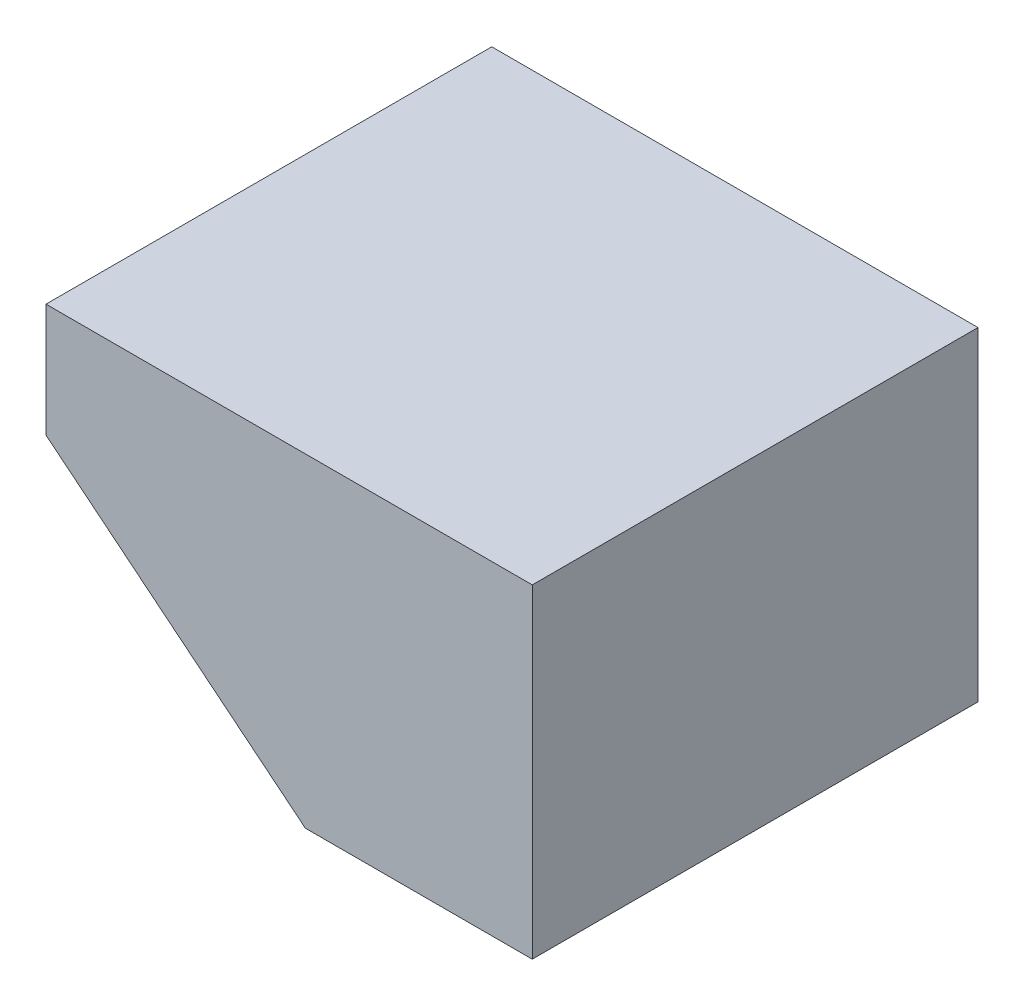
from build123d import *

# Parameters (mm, degrees)
SKETCH_1_W          = 60
SKETCH_1_H          = 40
EXTRUDE_1_DEPTH     = 55
CUT_EXTRUDE_1_DEPTH = 25


with BuildPart() as part:
    # Sketch 1 → Extrude 1 (new body)
    with BuildSketch(Plane.XY):
        with Locations((-30, 20)):
            Rectangle(SKETCH_1_W, SKETCH_1_H)
    extrude(amount=EXTRUDE_1_DEPTH)

    # Sketch 2 → Cut-Extrude 1 (cut)
    with BuildSketch(Plane.XY.offset(55)):
        Polygon((-60, 26), (-28, 0), (-60, 0), align=None)
    extrude(amount=-CUT_EXTRUDE_1_DEPTH, mode=Mode.SUBTRACT)


solid = part.part
